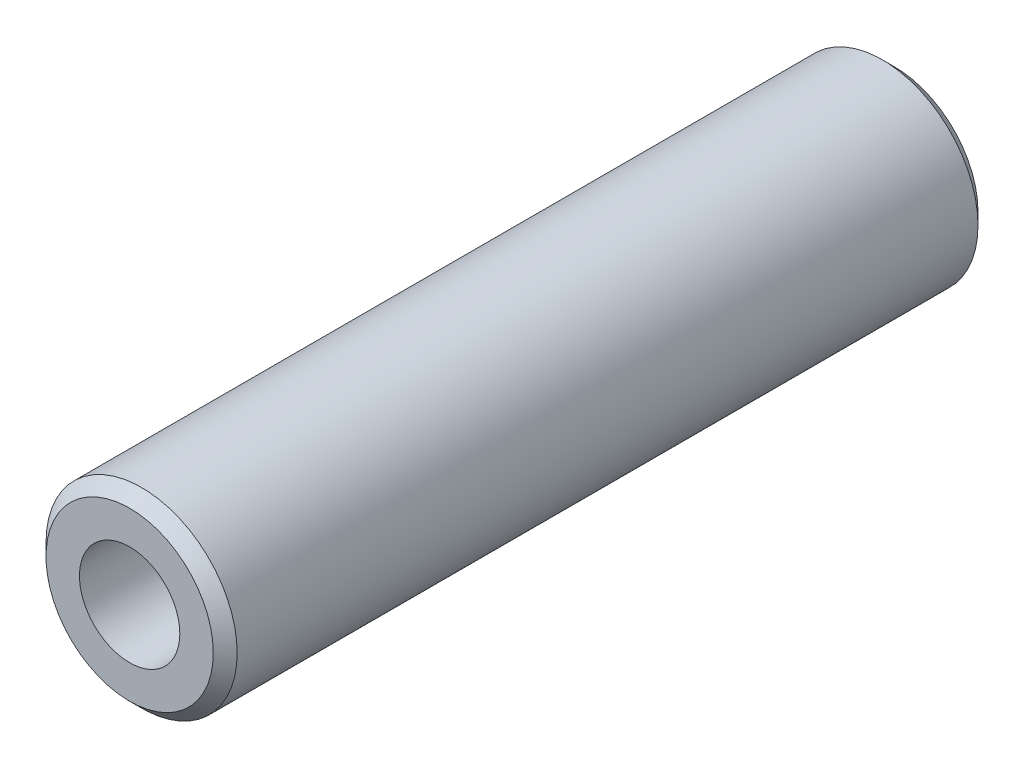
from build123d import *

# Parameters (mm, degrees)
ESQUISSE1_R               = 4
EXTRUSION1_DEPTH          = 16
CHANFREIN1_SIZE           = 0.5
TROU_TARAUD_M5X0_81_D     = 4.2
TROU_TARAUD_M5X0_81_DEPTH = 10.4
TROU_TARAUD_M5X0_81_TIP   = 1.2618073


with BuildPart() as part:
    # Esquisse1 → Extrusion1 (new, symmetric)
    with BuildSketch(Plane.XY):
        Circle(ESQUISSE1_R)
    extrude(amount=EXTRUSION1_DEPTH, both=True)

    # Chanfrein1
    chanfrein1_edges = [part.edges().sort_by_distance(p)[0] for p in [
        (-4, 0, -16),
        (-4, 0, 16),
    ]]
    chamfer(chanfrein1_edges, length=CHANFREIN1_SIZE)

    # Trou taraud_ M5x0.81
    with Locations(Plane.XY.offset(16)):
        with Locations((0, 0)):
            Hole(TROU_TARAUD_M5X0_81_D / 2, depth=TROU_TARAUD_M5X0_81_DEPTH)
            with Locations((0, 0, -(TROU_TARAUD_M5X0_81_DEPTH + TROU_TARAUD_M5X0_81_TIP / 2))):  # 118° drill point
                Cone(0, TROU_TARAUD_M5X0_81_D / 2, TROU_TARAUD_M5X0_81_TIP, mode=Mode.SUBTRACT)


solid = part.part
